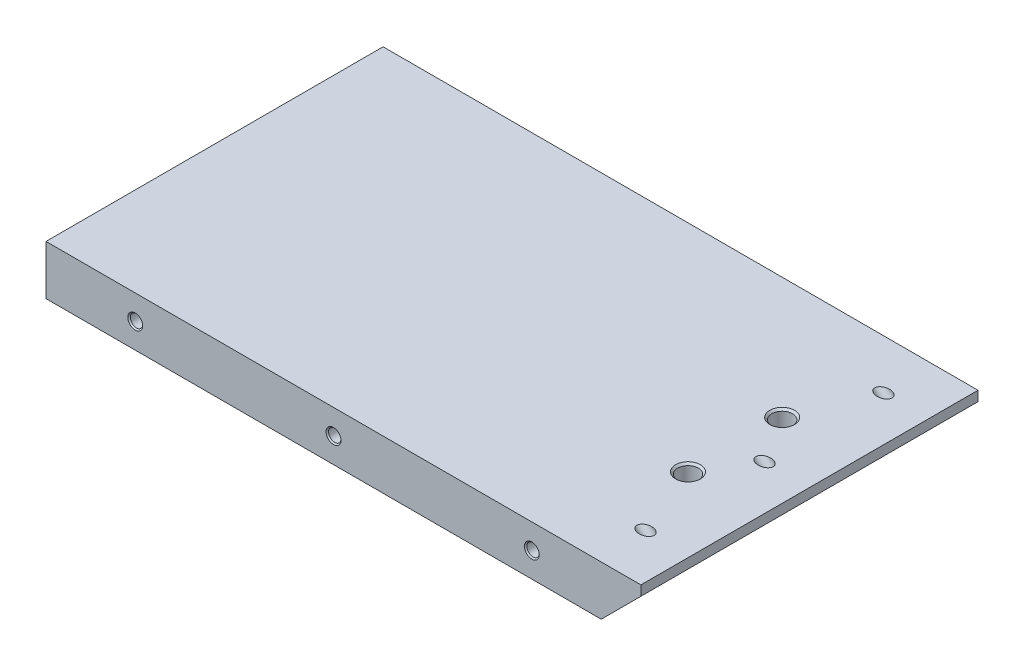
ISO-10303-21;
HEADER;
FILE_DESCRIPTION(('STEP AP214'),'2;1');
FILE_NAME('part.step','',(''),(''),'','','');
FILE_SCHEMA(('AUTOMOTIVE_DESIGN { 1 0 10303 214 1 1 1 1 }'));
ENDSEC;
DATA;
#1=APPLICATION_CONTEXT('core data for automotive mechanical design processes');
#2=APPLICATION_PROTOCOL_DEFINITION('international standard','automotive_design',2000,#1);
#3=PRODUCT_CONTEXT('',#1,'mechanical');
#4=PRODUCT('Part','Part','',(#3));
#5=PRODUCT_RELATED_PRODUCT_CATEGORY('part','',(#4));
#6=PRODUCT_DEFINITION_FORMATION('','',#4);
#7=PRODUCT_DEFINITION_CONTEXT('part definition',#1,'design');
#8=PRODUCT_DEFINITION('design','',#6,#7);
#9=PRODUCT_DEFINITION_SHAPE('','',#8);
#10=(LENGTH_UNIT() NAMED_UNIT(*) SI_UNIT(.MILLI.,.METRE.));
#11=(NAMED_UNIT(*) PLANE_ANGLE_UNIT() SI_UNIT($,.RADIAN.));
#12=(NAMED_UNIT(*) SI_UNIT($,.STERADIAN.) SOLID_ANGLE_UNIT());
#13=UNCERTAINTY_MEASURE_WITH_UNIT(LENGTH_MEASURE(1.E-05),#10,'distance_accuracy_value','');
#14=(GEOMETRIC_REPRESENTATION_CONTEXT(3) GLOBAL_UNCERTAINTY_ASSIGNED_CONTEXT((#13)) GLOBAL_UNIT_ASSIGNED_CONTEXT((#10,
#11,#12)) REPRESENTATION_CONTEXT('',''));
#15=CARTESIAN_POINT('',(0.,0.,0.));
#16=DIRECTION('',(0.,0.,1.));
#17=DIRECTION('',(1.,0.,0.));
#18=AXIS2_PLACEMENT_3D('',#15,#16,#17);
#19=CARTESIAN_POINT('',(0.,-5.,34.));
#20=DIRECTION('',(1.,0.,0.));
#21=DIRECTION('',(0.,1.,0.));
#22=AXIS2_PLACEMENT_3D('',#19,#20,#21);
#23=PLANE('',#22);
#24=CARTESIAN_POINT('',(0.,0.,22.5));
#25=DIRECTION('',(-1.,0.,0.));
#26=DIRECTION('',(0.,0.,1.));
#27=AXIS2_PLACEMENT_3D('',#24,#25,#26);
#28=CIRCLE('',#27,3.);
#29=CARTESIAN_POINT('',(0.,0.,25.5));
#30=VERTEX_POINT('',#29);
#31=EDGE_CURVE('E198',#30,#30,#28,.T.);
#32=ORIENTED_EDGE('',*,*,#31,.F.);
#33=EDGE_LOOP('',(#32));
#34=FACE_BOUND('',#33,.T.);
#35=CARTESIAN_POINT('',(0.,0.,-22.5));
#36=DIRECTION('',(-1.,0.,0.));
#37=DIRECTION('',(0.,0.,1.));
#38=AXIS2_PLACEMENT_3D('',#35,#36,#37);
#39=CIRCLE('',#38,3.);
#40=CARTESIAN_POINT('',(0.,0.,-19.5));
#41=VERTEX_POINT('',#40);
#42=EDGE_CURVE('E213',#41,#41,#39,.T.);
#43=ORIENTED_EDGE('',*,*,#42,.F.);
#44=EDGE_LOOP('',(#43));
#45=FACE_BOUND('',#44,.T.);
#46=CARTESIAN_POINT('',(0.,0.,29.));
#47=DIRECTION('',(-1.,0.,0.));
#48=DIRECTION('',(0.,0.,1.));
#49=AXIS2_PLACEMENT_3D('',#46,#47,#48);
#50=CIRCLE('',#49,2.5);
#51=CARTESIAN_POINT('',(0.,0.,31.5));
#52=VERTEX_POINT('',#51);
#53=EDGE_CURVE('E216',#52,#52,#50,.T.);
#54=ORIENTED_EDGE('',*,*,#53,.F.);
#55=EDGE_LOOP('',(#54));
#56=FACE_BOUND('',#55,.T.);
#57=CARTESIAN_POINT('',(0.,0.,-29.));
#58=DIRECTION('',(-1.,0.,0.));
#59=DIRECTION('',(0.,0.,1.));
#60=AXIS2_PLACEMENT_3D('',#57,#58,#59);
#61=CIRCLE('',#60,2.5);
#62=CARTESIAN_POINT('',(0.,0.,-26.5));
#63=VERTEX_POINT('',#62);
#64=EDGE_CURVE('E231',#63,#63,#61,.T.);
#65=ORIENTED_EDGE('',*,*,#64,.F.);
#66=EDGE_LOOP('',(#65));
#67=FACE_BOUND('',#66,.T.);
#68=DIRECTION('',(0.,-1.,0.));
#69=VECTOR('',#68,1.);
#70=CARTESIAN_POINT('',(0.,-5.,-34.));
#71=LINE('',#70,#69);
#72=CARTESIAN_POINT('',(0.,5.,-34.));
#73=VERTEX_POINT('',#72);
#74=CARTESIAN_POINT('',(0.,-5.,-34.));
#75=VERTEX_POINT('',#74);
#76=EDGE_CURVE('E234',#73,#75,#71,.T.);
#77=ORIENTED_EDGE('',*,*,#76,.T.);
#78=DIRECTION('',(0.,0.,-1.));
#79=VECTOR('',#78,1.);
#80=CARTESIAN_POINT('',(0.,-5.,34.));
#81=LINE('',#80,#79);
#82=CARTESIAN_POINT('',(0.,-5.,34.));
#83=VERTEX_POINT('',#82);
#84=EDGE_CURVE('E258',#83,#75,#81,.T.);
#85=ORIENTED_EDGE('',*,*,#84,.F.);
#86=DIRECTION('',(0.,-1.,0.));
#87=VECTOR('',#86,1.);
#88=CARTESIAN_POINT('',(0.,-5.,34.));
#89=LINE('',#88,#87);
#90=CARTESIAN_POINT('',(0.,5.,34.));
#91=VERTEX_POINT('',#90);
#92=EDGE_CURVE('E243',#91,#83,#89,.T.);
#93=ORIENTED_EDGE('',*,*,#92,.F.);
#94=DIRECTION('',(0.,0.,-1.));
#95=VECTOR('',#94,1.);
#96=CARTESIAN_POINT('',(0.,5.,34.));
#97=LINE('',#96,#95);
#98=EDGE_CURVE('E252',#91,#73,#97,.T.);
#99=ORIENTED_EDGE('',*,*,#98,.T.);
#100=EDGE_LOOP('',(#77,#85,#93,#99));
#101=FACE_BOUND('',#100,.T.);
#102=ADVANCED_FACE('F33',(#34,#45,#56,#67,#101),#23,.F.);
#103=CARTESIAN_POINT('',(0.,-5.,34.));
#104=DIRECTION('',(0.,1.,0.));
#105=DIRECTION('',(-1.,0.,0.));
#106=AXIS2_PLACEMENT_3D('',#103,#104,#105);
#107=PLANE('',#106);
#108=CARTESIAN_POINT('',(105.,-5.,-9.5));
#109=DIRECTION('',(0.,1.,0.));
#110=DIRECTION('',(0.,0.,1.));
#111=AXIS2_PLACEMENT_3D('',#108,#109,#110);
#112=CIRCLE('',#111,2.1);
#113=CARTESIAN_POINT('',(105.,-5.,-7.4));
#114=VERTEX_POINT('',#113);
#115=EDGE_CURVE('E180',#114,#114,#112,.T.);
#116=ORIENTED_EDGE('',*,*,#115,.T.);
#117=EDGE_LOOP('',(#116));
#118=FACE_BOUND('',#117,.T.);
#119=CARTESIAN_POINT('',(105.,-5.,9.5));
#120=DIRECTION('',(0.,1.,0.));
#121=DIRECTION('',(0.,0.,1.));
#122=AXIS2_PLACEMENT_3D('',#119,#120,#121);
#123=CIRCLE('',#122,2.1);
#124=CARTESIAN_POINT('',(105.,-5.,11.6));
#125=VERTEX_POINT('',#124);
#126=EDGE_CURVE('E189',#125,#125,#123,.T.);
#127=ORIENTED_EDGE('',*,*,#126,.T.);
#128=EDGE_LOOP('',(#127));
#129=FACE_BOUND('',#128,.T.);
#130=DIRECTION('',(1.,0.,0.));
#131=VECTOR('',#130,1.);
#132=CARTESIAN_POINT('',(0.,-5.,-34.));
#133=LINE('',#132,#131);
#134=CARTESIAN_POINT('',(112.,-4.99999999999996,-34.));
#135=VERTEX_POINT('',#134);
#136=EDGE_CURVE('E237',#75,#135,#133,.T.);
#137=ORIENTED_EDGE('',*,*,#136,.T.);
#138=DIRECTION('',(0.,0.,1.));
#139=VECTOR('',#138,1.);
#140=CARTESIAN_POINT('',(112.,-4.99999999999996,34.));
#141=LINE('',#140,#139);
#142=CARTESIAN_POINT('',(112.,-4.99999999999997,34.));
#143=VERTEX_POINT('',#142);
#144=EDGE_CURVE('E51',#135,#143,#141,.T.);
#145=ORIENTED_EDGE('',*,*,#144,.T.);
#146=DIRECTION('',(1.,0.,0.));
#147=VECTOR('',#146,1.);
#148=CARTESIAN_POINT('',(0.,-5.,34.));
#149=LINE('',#148,#147);
#150=EDGE_CURVE('E246',#83,#143,#149,.T.);
#151=ORIENTED_EDGE('',*,*,#150,.F.);
#152=ORIENTED_EDGE('',*,*,#84,.T.);
#153=EDGE_LOOP('',(#137,#145,#151,#152));
#154=FACE_BOUND('',#153,.T.);
#155=ADVANCED_FACE('F311',(#118,#129,#154),#107,.F.);
#156=CARTESIAN_POINT('',(120.,-4.99999999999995,34.));
#157=DIRECTION('',(-1.,0.,0.));
#158=DIRECTION('',(0.,0.,1.));
#159=AXIS2_PLACEMENT_3D('',#156,#157,#158);
#160=PLANE('',#159);
#161=DIRECTION('',(0.,1.,0.));
#162=VECTOR('',#161,1.);
#163=CARTESIAN_POINT('',(120.,-4.99999999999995,34.));
#164=LINE('',#163,#162);
#165=CARTESIAN_POINT('',(120.,3.00000000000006,34.));
#166=VERTEX_POINT('',#165);
#167=CARTESIAN_POINT('',(120.,5.,34.));
#168=VERTEX_POINT('',#167);
#169=EDGE_CURVE('E248',#166,#168,#164,.T.);
#170=ORIENTED_EDGE('',*,*,#169,.F.);
#171=DIRECTION('',(0.,0.,-1.));
#172=VECTOR('',#171,1.);
#173=CARTESIAN_POINT('',(120.,3.00000000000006,34.));
#174=LINE('',#173,#172);
#175=CARTESIAN_POINT('',(120.,3.00000000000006,-34.));
#176=VERTEX_POINT('',#175);
#177=EDGE_CURVE('E261',#166,#176,#174,.T.);
#178=ORIENTED_EDGE('',*,*,#177,.T.);
#179=DIRECTION('',(0.,1.,0.));
#180=VECTOR('',#179,1.);
#181=CARTESIAN_POINT('',(120.,-4.99999999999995,-34.));
#182=LINE('',#181,#180);
#183=CARTESIAN_POINT('',(120.,5.,-34.));
#184=VERTEX_POINT('',#183);
#185=EDGE_CURVE('E239',#176,#184,#182,.T.);
#186=ORIENTED_EDGE('',*,*,#185,.T.);
#187=DIRECTION('',(0.,0.,-1.));
#188=VECTOR('',#187,1.);
#189=CARTESIAN_POINT('',(120.,5.,34.));
#190=LINE('',#189,#188);
#191=EDGE_CURVE('E255',#168,#184,#190,.T.);
#192=ORIENTED_EDGE('',*,*,#191,.F.);
#193=EDGE_LOOP('',(#170,#178,#186,#192));
#194=FACE_BOUND('',#193,.T.);
#195=ADVANCED_FACE('F317',(#194),#160,.F.);
#196=CARTESIAN_POINT('',(0.,5.,34.));
#197=DIRECTION('',(0.,-1.,0.));
#198=DIRECTION('',(1.,0.,0.));
#199=AXIS2_PLACEMENT_3D('',#196,#197,#198);
#200=PLANE('',#199);
#201=CARTESIAN_POINT('',(110.928932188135,5.,-24.));
#202=DIRECTION('',(0.,-1.,0.));
#203=DIRECTION('',(1.,0.,0.));
#204=AXIS2_PLACEMENT_3D('',#201,#202,#203);
#205=ELLIPSE('',#204,1.76776695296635,1.24999999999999);
#206=CARTESIAN_POINT('',(112.696699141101,5.,-24.));
#207=VERTEX_POINT('',#206);
#208=EDGE_CURVE('E165',#207,#207,#205,.T.);
#209=ORIENTED_EDGE('',*,*,#208,.T.);
#210=EDGE_LOOP('',(#209));
#211=FACE_BOUND('',#210,.T.);
#212=CARTESIAN_POINT('',(110.928932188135,5.,0.));
#213=DIRECTION('',(0.,-1.,0.));
#214=DIRECTION('',(1.,0.,0.));
#215=AXIS2_PLACEMENT_3D('',#212,#213,#214);
#216=ELLIPSE('',#215,1.76776695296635,1.24999999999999);
#217=CARTESIAN_POINT('',(112.696699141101,5.,0.));
#218=VERTEX_POINT('',#217);
#219=EDGE_CURVE('E172',#218,#218,#216,.T.);
#220=ORIENTED_EDGE('',*,*,#219,.T.);
#221=EDGE_LOOP('',(#220));
#222=FACE_BOUND('',#221,.T.);
#223=CARTESIAN_POINT('',(110.928932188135,5.,24.));
#224=DIRECTION('',(0.,-1.,0.));
#225=DIRECTION('',(1.,0.,0.));
#226=AXIS2_PLACEMENT_3D('',#223,#224,#225);
#227=ELLIPSE('',#226,1.76776695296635,1.24999999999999);
#228=CARTESIAN_POINT('',(112.696699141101,5.,24.));
#229=VERTEX_POINT('',#228);
#230=EDGE_CURVE('E179',#229,#229,#227,.T.);
#231=ORIENTED_EDGE('',*,*,#230,.T.);
#232=EDGE_LOOP('',(#231));
#233=FACE_BOUND('',#232,.T.);
#234=CARTESIAN_POINT('',(105.,5.,-9.5));
#235=DIRECTION('',(0.,1.,0.));
#236=DIRECTION('',(0.,0.,1.));
#237=AXIS2_PLACEMENT_3D('',#234,#235,#236);
#238=CIRCLE('',#237,2.5);
#239=CARTESIAN_POINT('',(105.,5.,-7.));
#240=VERTEX_POINT('',#239);
#241=EDGE_CURVE('E186',#240,#240,#238,.T.);
#242=ORIENTED_EDGE('',*,*,#241,.F.);
#243=EDGE_LOOP('',(#242));
#244=FACE_BOUND('',#243,.T.);
#245=CARTESIAN_POINT('',(105.,5.,9.5));
#246=DIRECTION('',(0.,1.,0.));
#247=DIRECTION('',(0.,0.,1.));
#248=AXIS2_PLACEMENT_3D('',#245,#246,#247);
#249=CIRCLE('',#248,2.5);
#250=CARTESIAN_POINT('',(105.,5.,12.));
#251=VERTEX_POINT('',#250);
#252=EDGE_CURVE('E195',#251,#251,#249,.T.);
#253=ORIENTED_EDGE('',*,*,#252,.F.);
#254=EDGE_LOOP('',(#253));
#255=FACE_BOUND('',#254,.T.);
#256=DIRECTION('',(-1.,0.,0.));
#257=VECTOR('',#256,1.);
#258=CARTESIAN_POINT('',(0.,5.,-34.));
#259=LINE('',#258,#257);
#260=EDGE_CURVE('E241',#184,#73,#259,.T.);
#261=ORIENTED_EDGE('',*,*,#260,.T.);
#262=ORIENTED_EDGE('',*,*,#98,.F.);
#263=DIRECTION('',(-1.,0.,0.));
#264=VECTOR('',#263,1.);
#265=CARTESIAN_POINT('',(0.,5.,34.));
#266=LINE('',#265,#264);
#267=EDGE_CURVE('E250',#168,#91,#266,.T.);
#268=ORIENTED_EDGE('',*,*,#267,.F.);
#269=ORIENTED_EDGE('',*,*,#191,.T.);
#270=EDGE_LOOP('',(#261,#262,#268,#269));
#271=FACE_BOUND('',#270,.T.);
#272=ADVANCED_FACE('F305',(#211,#222,#233,#244,#255,#271),#200,.F.);
#273=CARTESIAN_POINT('',(0.,-5.,34.));
#274=DIRECTION('',(0.,0.,-1.));
#275=DIRECTION('',(-1.,0.,0.));
#276=AXIS2_PLACEMENT_3D('',#273,#274,#275);
#277=PLANE('',#276);
#278=CARTESIAN_POINT('',(98.,0.,34.));
#279=DIRECTION('',(0.,0.,1.));
#280=DIRECTION('',(1.,0.,0.));
#281=AXIS2_PLACEMENT_3D('',#278,#279,#280);
#282=CIRCLE('',#281,1.5);
#283=CARTESIAN_POINT('',(99.5,0.,34.));
#284=VERTEX_POINT('',#283);
#285=EDGE_CURVE('E138',#284,#284,#282,.T.);
#286=ORIENTED_EDGE('',*,*,#285,.F.);
#287=EDGE_LOOP('',(#286));
#288=FACE_BOUND('',#287,.T.);
#289=CARTESIAN_POINT('',(58.,0.,34.));
#290=DIRECTION('',(0.,0.,1.));
#291=DIRECTION('',(1.,0.,0.));
#292=AXIS2_PLACEMENT_3D('',#289,#290,#291);
#293=CIRCLE('',#292,1.5);
#294=CARTESIAN_POINT('',(59.5,0.,34.));
#295=VERTEX_POINT('',#294);
#296=EDGE_CURVE('E147',#295,#295,#293,.T.);
#297=ORIENTED_EDGE('',*,*,#296,.F.);
#298=EDGE_LOOP('',(#297));
#299=FACE_BOUND('',#298,.T.);
#300=CARTESIAN_POINT('',(18.,0.,34.));
#301=DIRECTION('',(0.,0.,1.));
#302=DIRECTION('',(1.,0.,0.));
#303=AXIS2_PLACEMENT_3D('',#300,#301,#302);
#304=CIRCLE('',#303,1.5);
#305=CARTESIAN_POINT('',(19.5,0.,34.));
#306=VERTEX_POINT('',#305);
#307=EDGE_CURVE('E156',#306,#306,#304,.T.);
#308=ORIENTED_EDGE('',*,*,#307,.F.);
#309=EDGE_LOOP('',(#308));
#310=FACE_BOUND('',#309,.T.);
#311=ORIENTED_EDGE('',*,*,#150,.T.);
#312=DIRECTION('',(-0.707106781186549,-0.707106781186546,0.));
#313=VECTOR('',#312,1.);
#314=CARTESIAN_POINT('',(120.,3.00000000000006,34.));
#315=LINE('',#314,#313);
#316=EDGE_CURVE('E267',#143,#166,#315,.F.);
#317=ORIENTED_EDGE('',*,*,#316,.T.);
#318=ORIENTED_EDGE('',*,*,#169,.T.);
#319=ORIENTED_EDGE('',*,*,#267,.T.);
#320=ORIENTED_EDGE('',*,*,#92,.T.);
#321=EDGE_LOOP('',(#311,#317,#318,#319,#320));
#322=FACE_BOUND('',#321,.T.);
#323=ADVANCED_FACE('F295',(#288,#299,#310,#322),#277,.F.);
#324=CARTESIAN_POINT('',(0.,-5.,-34.));
#325=DIRECTION('',(0.,0.,-1.));
#326=DIRECTION('',(-1.,0.,0.));
#327=AXIS2_PLACEMENT_3D('',#324,#325,#326);
#328=PLANE('',#327);
#329=CARTESIAN_POINT('',(58.,0.,-34.));
#330=DIRECTION('',(0.,0.,-1.));
#331=DIRECTION('',(-1.,0.,0.));
#332=AXIS2_PLACEMENT_3D('',#329,#330,#331);
#333=CIRCLE('',#332,1.5);
#334=CARTESIAN_POINT('',(56.5,0.,-34.));
#335=VERTEX_POINT('',#334);
#336=EDGE_CURVE('E123',#335,#335,#333,.T.);
#337=ORIENTED_EDGE('',*,*,#336,.F.);
#338=EDGE_LOOP('',(#337));
#339=FACE_BOUND('',#338,.T.);
#340=CARTESIAN_POINT('',(18.,0.,-34.));
#341=DIRECTION('',(0.,0.,-1.));
#342=DIRECTION('',(-1.,0.,0.));
#343=AXIS2_PLACEMENT_3D('',#340,#341,#342);
#344=CIRCLE('',#343,1.5);
#345=CARTESIAN_POINT('',(16.5,0.,-34.));
#346=VERTEX_POINT('',#345);
#347=EDGE_CURVE('E116',#346,#346,#344,.T.);
#348=ORIENTED_EDGE('',*,*,#347,.F.);
#349=EDGE_LOOP('',(#348));
#350=FACE_BOUND('',#349,.T.);
#351=ORIENTED_EDGE('',*,*,#185,.F.);
#352=DIRECTION('',(0.707106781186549,0.707106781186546,0.));
#353=VECTOR('',#352,1.);
#354=CARTESIAN_POINT('',(55.9999999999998,-61.,-34.));
#355=LINE('',#354,#353);
#356=EDGE_CURVE('E264',#176,#135,#355,.F.);
#357=ORIENTED_EDGE('',*,*,#356,.T.);
#358=ORIENTED_EDGE('',*,*,#136,.F.);
#359=ORIENTED_EDGE('',*,*,#76,.F.);
#360=ORIENTED_EDGE('',*,*,#260,.F.);
#361=EDGE_LOOP('',(#351,#357,#358,#359,#360));
#362=FACE_BOUND('',#361,.T.);
#363=CARTESIAN_POINT('',(98.,0.,-34.));
#364=DIRECTION('',(0.,0.,-1.));
#365=DIRECTION('',(-1.,0.,0.));
#366=AXIS2_PLACEMENT_3D('',#363,#364,#365);
#367=CIRCLE('',#366,1.5);
#368=CARTESIAN_POINT('',(96.5,0.,-34.));
#369=VERTEX_POINT('',#368);
#370=EDGE_CURVE('E269',#369,#369,#367,.T.);
#371=ORIENTED_EDGE('',*,*,#370,.F.);
#372=EDGE_LOOP('',(#371));
#373=FACE_BOUND('',#372,.T.);
#374=ADVANCED_FACE('F292',(#339,#350,#362,#373),#328,.T.);
#375=CARTESIAN_POINT('',(120.,3.00000000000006,34.));
#376=DIRECTION('',(-0.707106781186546,0.707106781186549,0.));
#377=DIRECTION('',(-0.707106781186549,-0.707106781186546,0.));
#378=AXIS2_PLACEMENT_3D('',#375,#376,#377);
#379=PLANE('',#378);
#380=CARTESIAN_POINT('',(116.464466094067,-0.535533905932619,-24.));
#381=DIRECTION('',(0.707106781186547,-0.707106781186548,0.));
#382=DIRECTION('',(0.707106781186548,0.707106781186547,0.));
#383=AXIS2_PLACEMENT_3D('',#380,#381,#382);
#384=CIRCLE('',#383,2.);
#385=CARTESIAN_POINT('',(117.87867965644,0.878679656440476,-24.));
#386=VERTEX_POINT('',#385);
#387=EDGE_CURVE('E162',#386,#386,#384,.T.);
#388=ORIENTED_EDGE('',*,*,#387,.F.);
#389=EDGE_LOOP('',(#388));
#390=FACE_BOUND('',#389,.T.);
#391=CARTESIAN_POINT('',(116.464466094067,-0.535533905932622,0.));
#392=DIRECTION('',(0.707106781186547,-0.707106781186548,0.));
#393=DIRECTION('',(0.707106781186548,0.707106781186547,0.));
#394=AXIS2_PLACEMENT_3D('',#391,#392,#393);
#395=CIRCLE('',#394,2.);
#396=CARTESIAN_POINT('',(117.87867965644,0.878679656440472,0.));
#397=VERTEX_POINT('',#396);
#398=EDGE_CURVE('E169',#397,#397,#395,.T.);
#399=ORIENTED_EDGE('',*,*,#398,.F.);
#400=EDGE_LOOP('',(#399));
#401=FACE_BOUND('',#400,.T.);
#402=CARTESIAN_POINT('',(116.464466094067,-0.535533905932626,24.));
#403=DIRECTION('',(0.707106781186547,-0.707106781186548,0.));
#404=DIRECTION('',(0.707106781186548,0.707106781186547,0.));
#405=AXIS2_PLACEMENT_3D('',#402,#403,#404);
#406=CIRCLE('',#405,2.);
#407=CARTESIAN_POINT('',(117.87867965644,0.878679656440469,24.));
#408=VERTEX_POINT('',#407);
#409=EDGE_CURVE('E176',#408,#408,#406,.T.);
#410=ORIENTED_EDGE('',*,*,#409,.F.);
#411=EDGE_LOOP('',(#410));
#412=FACE_BOUND('',#411,.T.);
#413=ORIENTED_EDGE('',*,*,#316,.F.);
#414=ORIENTED_EDGE('',*,*,#144,.F.);
#415=ORIENTED_EDGE('',*,*,#356,.F.);
#416=ORIENTED_EDGE('',*,*,#177,.F.);
#417=EDGE_LOOP('',(#413,#414,#415,#416));
#418=FACE_BOUND('',#417,.T.);
#419=ADVANCED_FACE('F294',(#390,#401,#412,#418),#379,.F.);
#420=CARTESIAN_POINT('',(0.,0.,-29.));
#421=DIRECTION('',(-1.,0.,0.));
#422=DIRECTION('',(0.,0.,1.));
#423=AXIS2_PLACEMENT_3D('',#420,#421,#422);
#424=CONICAL_SURFACE('',#423,2.5,0.785398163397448);
#425=CARTESIAN_POINT('',(0.400000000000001,0.,-29.));
#426=DIRECTION('',(-1.,0.,0.));
#427=DIRECTION('',(0.,0.,1.));
#428=AXIS2_PLACEMENT_3D('',#425,#426,#427);
#429=CIRCLE('',#428,2.1);
#430=CARTESIAN_POINT('',(0.400000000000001,0.,-26.9));
#431=VERTEX_POINT('',#430);
#432=EDGE_CURVE('E228',#431,#431,#429,.T.);
#433=ORIENTED_EDGE('',*,*,#432,.F.);
#434=EDGE_LOOP('',(#433));
#435=FACE_BOUND('',#434,.T.);
#436=ORIENTED_EDGE('',*,*,#64,.T.);
#437=EDGE_LOOP('',(#436));
#438=FACE_BOUND('',#437,.T.);
#439=ADVANCED_FACE('F302',(#435,#438),#424,.F.);
#440=CARTESIAN_POINT('',(0.,0.,-29.));
#441=DIRECTION('',(-1.,0.,0.));
#442=DIRECTION('',(0.,0.,1.));
#443=AXIS2_PLACEMENT_3D('',#440,#441,#442);
#444=CYLINDRICAL_SURFACE('',#443,2.1);
#445=CARTESIAN_POINT('',(15.,0.,-29.));
#446=DIRECTION('',(-1.,0.,0.));
#447=DIRECTION('',(0.,0.,1.));
#448=AXIS2_PLACEMENT_3D('',#445,#446,#447);
#449=CIRCLE('',#448,2.1);
#450=CARTESIAN_POINT('',(15.,0.,-26.9));
#451=VERTEX_POINT('',#450);
#452=EDGE_CURVE('E225',#451,#451,#449,.T.);
#453=ORIENTED_EDGE('',*,*,#452,.F.);
#454=EDGE_LOOP('',(#453));
#455=FACE_BOUND('',#454,.T.);
#456=ORIENTED_EDGE('',*,*,#432,.T.);
#457=EDGE_LOOP('',(#456));
#458=FACE_BOUND('',#457,.T.);
#459=ADVANCED_FACE('F611',(#455,#458),#444,.F.);
#460=CARTESIAN_POINT('',(15.,0.,-29.));
#461=DIRECTION('',(-1.,0.,0.));
#462=DIRECTION('',(0.,0.,1.));
#463=AXIS2_PLACEMENT_3D('',#460,#461,#462);
#464=CONICAL_SURFACE('',#463,2.1,1.02974425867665);
#465=CARTESIAN_POINT('',(16.2618072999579,0.,-29.));
#466=VERTEX_POINT('',#465);
#467=VERTEX_LOOP('',#466);
#468=FACE_BOUND('',#467,.T.);
#469=ORIENTED_EDGE('',*,*,#452,.T.);
#470=EDGE_LOOP('',(#469));
#471=FACE_BOUND('',#470,.T.);
#472=ADVANCED_FACE('F591',(#468,#471),#464,.F.);
#473=CARTESIAN_POINT('',(0.,0.,29.));
#474=DIRECTION('',(-1.,0.,0.));
#475=DIRECTION('',(0.,0.,1.));
#476=AXIS2_PLACEMENT_3D('',#473,#474,#475);
#477=CONICAL_SURFACE('',#476,2.5,0.785398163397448);
#478=CARTESIAN_POINT('',(0.400000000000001,0.,29.));
#479=DIRECTION('',(-1.,0.,0.));
#480=DIRECTION('',(0.,0.,1.));
#481=AXIS2_PLACEMENT_3D('',#478,#479,#480);
#482=CIRCLE('',#481,2.1);
#483=CARTESIAN_POINT('',(0.400000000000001,0.,31.1));
#484=VERTEX_POINT('',#483);
#485=EDGE_CURVE('E222',#484,#484,#482,.T.);
#486=ORIENTED_EDGE('',*,*,#485,.F.);
#487=EDGE_LOOP('',(#486));
#488=FACE_BOUND('',#487,.T.);
#489=ORIENTED_EDGE('',*,*,#53,.T.);
#490=EDGE_LOOP('',(#489));
#491=FACE_BOUND('',#490,.T.);
#492=ADVANCED_FACE('F582',(#488,#491),#477,.F.);
#493=CARTESIAN_POINT('',(0.,0.,29.));
#494=DIRECTION('',(-1.,0.,0.));
#495=DIRECTION('',(0.,0.,1.));
#496=AXIS2_PLACEMENT_3D('',#493,#494,#495);
#497=CYLINDRICAL_SURFACE('',#496,2.1);
#498=CARTESIAN_POINT('',(15.,0.,29.));
#499=DIRECTION('',(-1.,0.,0.));
#500=DIRECTION('',(0.,0.,1.));
#501=AXIS2_PLACEMENT_3D('',#498,#499,#500);
#502=CIRCLE('',#501,2.1);
#503=CARTESIAN_POINT('',(15.,0.,31.1));
#504=VERTEX_POINT('',#503);
#505=EDGE_CURVE('E219',#504,#504,#502,.T.);
#506=ORIENTED_EDGE('',*,*,#505,.F.);
#507=EDGE_LOOP('',(#506));
#508=FACE_BOUND('',#507,.T.);
#509=ORIENTED_EDGE('',*,*,#485,.T.);
#510=EDGE_LOOP('',(#509));
#511=FACE_BOUND('',#510,.T.);
#512=ADVANCED_FACE('F588',(#508,#511),#497,.F.);
#513=CARTESIAN_POINT('',(15.,0.,29.));
#514=DIRECTION('',(-1.,0.,0.));
#515=DIRECTION('',(0.,0.,1.));
#516=AXIS2_PLACEMENT_3D('',#513,#514,#515);
#517=CONICAL_SURFACE('',#516,2.1,1.02974425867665);
#518=CARTESIAN_POINT('',(16.2618072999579,0.,29.));
#519=VERTEX_POINT('',#518);
#520=VERTEX_LOOP('',#519);
#521=FACE_BOUND('',#520,.T.);
#522=ORIENTED_EDGE('',*,*,#505,.T.);
#523=EDGE_LOOP('',(#522));
#524=FACE_BOUND('',#523,.T.);
#525=ADVANCED_FACE('F579',(#521,#524),#517,.F.);
#526=CARTESIAN_POINT('',(0.,0.,-22.5));
#527=DIRECTION('',(-1.,0.,0.));
#528=DIRECTION('',(0.,0.,1.));
#529=AXIS2_PLACEMENT_3D('',#526,#527,#528);
#530=CONICAL_SURFACE('',#529,3.,0.785398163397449);
#531=CARTESIAN_POINT('',(0.5,0.,-22.5));
#532=DIRECTION('',(-1.,0.,0.));
#533=DIRECTION('',(0.,0.,1.));
#534=AXIS2_PLACEMENT_3D('',#531,#532,#533);
#535=CIRCLE('',#534,2.5);
#536=CARTESIAN_POINT('',(0.5,0.,-20.));
#537=VERTEX_POINT('',#536);
#538=EDGE_CURVE('E210',#537,#537,#535,.T.);
#539=ORIENTED_EDGE('',*,*,#538,.F.);
#540=EDGE_LOOP('',(#539));
#541=FACE_BOUND('',#540,.T.);
#542=ORIENTED_EDGE('',*,*,#42,.T.);
#543=EDGE_LOOP('',(#542));
#544=FACE_BOUND('',#543,.T.);
#545=ADVANCED_FACE('F571',(#541,#544),#530,.F.);
#546=CARTESIAN_POINT('',(0.,0.,-22.5));
#547=DIRECTION('',(-1.,0.,0.));
#548=DIRECTION('',(0.,0.,1.));
#549=AXIS2_PLACEMENT_3D('',#546,#547,#548);
#550=CYLINDRICAL_SURFACE('',#549,2.5);
#551=CARTESIAN_POINT('',(12.,0.,-22.5));
#552=DIRECTION('',(-1.,0.,0.));
#553=DIRECTION('',(0.,0.,1.));
#554=AXIS2_PLACEMENT_3D('',#551,#552,#553);
#555=CIRCLE('',#554,2.5);
#556=CARTESIAN_POINT('',(12.,0.,-20.));
#557=VERTEX_POINT('',#556);
#558=EDGE_CURVE('E207',#557,#557,#555,.T.);
#559=ORIENTED_EDGE('',*,*,#558,.F.);
#560=EDGE_LOOP('',(#559));
#561=FACE_BOUND('',#560,.T.);
#562=ORIENTED_EDGE('',*,*,#538,.T.);
#563=EDGE_LOOP('',(#562));
#564=FACE_BOUND('',#563,.T.);
#565=ADVANCED_FACE('F563',(#561,#564),#550,.F.);
#566=CARTESIAN_POINT('',(12.,0.,-22.5));
#567=DIRECTION('',(-1.,0.,0.));
#568=DIRECTION('',(0.,0.,1.));
#569=AXIS2_PLACEMENT_3D('',#566,#567,#568);
#570=CONICAL_SURFACE('',#569,2.5,1.02974425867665);
#571=CARTESIAN_POINT('',(13.5021515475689,0.,-22.5));
#572=VERTEX_POINT('',#571);
#573=VERTEX_LOOP('',#572);
#574=FACE_BOUND('',#573,.T.);
#575=ORIENTED_EDGE('',*,*,#558,.T.);
#576=EDGE_LOOP('',(#575));
#577=FACE_BOUND('',#576,.T.);
#578=ADVANCED_FACE('F543',(#574,#577),#570,.F.);
#579=CARTESIAN_POINT('',(0.,0.,22.5));
#580=DIRECTION('',(-1.,0.,0.));
#581=DIRECTION('',(0.,0.,1.));
#582=AXIS2_PLACEMENT_3D('',#579,#580,#581);
#583=CONICAL_SURFACE('',#582,3.,0.785398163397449);
#584=CARTESIAN_POINT('',(0.5,0.,22.5));
#585=DIRECTION('',(-1.,0.,0.));
#586=DIRECTION('',(0.,0.,1.));
#587=AXIS2_PLACEMENT_3D('',#584,#585,#586);
#588=CIRCLE('',#587,2.5);
#589=CARTESIAN_POINT('',(0.5,0.,25.));
#590=VERTEX_POINT('',#589);
#591=EDGE_CURVE('E204',#590,#590,#588,.T.);
#592=ORIENTED_EDGE('',*,*,#591,.F.);
#593=EDGE_LOOP('',(#592));
#594=FACE_BOUND('',#593,.T.);
#595=ORIENTED_EDGE('',*,*,#31,.T.);
#596=EDGE_LOOP('',(#595));
#597=FACE_BOUND('',#596,.T.);
#598=ADVANCED_FACE('F534',(#594,#597),#583,.F.);
#599=CARTESIAN_POINT('',(0.,0.,22.5));
#600=DIRECTION('',(-1.,0.,0.));
#601=DIRECTION('',(0.,0.,1.));
#602=AXIS2_PLACEMENT_3D('',#599,#600,#601);
#603=CYLINDRICAL_SURFACE('',#602,2.5);
#604=CARTESIAN_POINT('',(12.,0.,22.5));
#605=DIRECTION('',(-1.,0.,0.));
#606=DIRECTION('',(0.,0.,1.));
#607=AXIS2_PLACEMENT_3D('',#604,#605,#606);
#608=CIRCLE('',#607,2.5);
#609=CARTESIAN_POINT('',(12.,0.,25.));
#610=VERTEX_POINT('',#609);
#611=EDGE_CURVE('E201',#610,#610,#608,.T.);
#612=ORIENTED_EDGE('',*,*,#611,.F.);
#613=EDGE_LOOP('',(#612));
#614=FACE_BOUND('',#613,.T.);
#615=ORIENTED_EDGE('',*,*,#591,.T.);
#616=EDGE_LOOP('',(#615));
#617=FACE_BOUND('',#616,.T.);
#618=ADVANCED_FACE('F540',(#614,#617),#603,.F.);
#619=CARTESIAN_POINT('',(12.,0.,22.5));
#620=DIRECTION('',(-1.,0.,0.));
#621=DIRECTION('',(0.,0.,1.));
#622=AXIS2_PLACEMENT_3D('',#619,#620,#621);
#623=CONICAL_SURFACE('',#622,2.5,1.02974425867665);
#624=CARTESIAN_POINT('',(13.5021515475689,0.,22.5));
#625=VERTEX_POINT('',#624);
#626=VERTEX_LOOP('',#625);
#627=FACE_BOUND('',#626,.T.);
#628=ORIENTED_EDGE('',*,*,#611,.T.);
#629=EDGE_LOOP('',(#628));
#630=FACE_BOUND('',#629,.T.);
#631=ADVANCED_FACE('F531',(#627,#630),#623,.F.);
#632=CARTESIAN_POINT('',(105.,5.,9.5));
#633=DIRECTION('',(0.,1.,0.));
#634=DIRECTION('',(0.,0.,1.));
#635=AXIS2_PLACEMENT_3D('',#632,#633,#634);
#636=CONICAL_SURFACE('',#635,2.5,0.78539816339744);
#637=CARTESIAN_POINT('',(105.,4.6,9.5));
#638=DIRECTION('',(0.,1.,0.));
#639=DIRECTION('',(0.,0.,1.));
#640=AXIS2_PLACEMENT_3D('',#637,#638,#639);
#641=CIRCLE('',#640,2.1);
#642=CARTESIAN_POINT('',(105.,4.6,11.6));
#643=VERTEX_POINT('',#642);
#644=EDGE_CURVE('E192',#643,#643,#641,.T.);
#645=ORIENTED_EDGE('',*,*,#644,.F.);
#646=EDGE_LOOP('',(#645));
#647=FACE_BOUND('',#646,.T.);
#648=ORIENTED_EDGE('',*,*,#252,.T.);
#649=EDGE_LOOP('',(#648));
#650=FACE_BOUND('',#649,.T.);
#651=ADVANCED_FACE('F523',(#647,#650),#636,.F.);
#652=CARTESIAN_POINT('',(105.,5.,9.5));
#653=DIRECTION('',(0.,1.,0.));
#654=DIRECTION('',(0.,0.,1.));
#655=AXIS2_PLACEMENT_3D('',#652,#653,#654);
#656=CYLINDRICAL_SURFACE('',#655,2.1);
#657=ORIENTED_EDGE('',*,*,#126,.F.);
#658=EDGE_LOOP('',(#657));
#659=FACE_BOUND('',#658,.T.);
#660=ORIENTED_EDGE('',*,*,#644,.T.);
#661=EDGE_LOOP('',(#660));
#662=FACE_BOUND('',#661,.T.);
#663=ADVANCED_FACE('F514',(#659,#662),#656,.F.);
#664=CARTESIAN_POINT('',(105.,5.,-9.5));
#665=DIRECTION('',(0.,1.,0.));
#666=DIRECTION('',(0.,0.,1.));
#667=AXIS2_PLACEMENT_3D('',#664,#665,#666);
#668=CONICAL_SURFACE('',#667,2.5,0.78539816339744);
#669=CARTESIAN_POINT('',(105.,4.6,-9.5));
#670=DIRECTION('',(0.,1.,0.));
#671=DIRECTION('',(0.,0.,1.));
#672=AXIS2_PLACEMENT_3D('',#669,#670,#671);
#673=CIRCLE('',#672,2.1);
#674=CARTESIAN_POINT('',(105.,4.6,-7.4));
#675=VERTEX_POINT('',#674);
#676=EDGE_CURVE('E183',#675,#675,#673,.T.);
#677=ORIENTED_EDGE('',*,*,#676,.F.);
#678=EDGE_LOOP('',(#677));
#679=FACE_BOUND('',#678,.T.);
#680=ORIENTED_EDGE('',*,*,#241,.T.);
#681=EDGE_LOOP('',(#680));
#682=FACE_BOUND('',#681,.T.);
#683=ADVANCED_FACE('F506',(#679,#682),#668,.F.);
#684=CARTESIAN_POINT('',(105.,5.,-9.5));
#685=DIRECTION('',(0.,1.,0.));
#686=DIRECTION('',(0.,0.,1.));
#687=AXIS2_PLACEMENT_3D('',#684,#685,#686);
#688=CYLINDRICAL_SURFACE('',#687,2.1);
#689=ORIENTED_EDGE('',*,*,#115,.F.);
#690=EDGE_LOOP('',(#689));
#691=FACE_BOUND('',#690,.T.);
#692=ORIENTED_EDGE('',*,*,#676,.T.);
#693=EDGE_LOOP('',(#692));
#694=FACE_BOUND('',#693,.T.);
#695=ADVANCED_FACE('F498',(#691,#694),#688,.F.);
#696=CARTESIAN_POINT('',(116.464466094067,-0.535533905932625,24.));
#697=DIRECTION('',(0.707106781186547,-0.707106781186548,0.));
#698=DIRECTION('',(0.707106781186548,0.707106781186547,0.));
#699=AXIS2_PLACEMENT_3D('',#696,#697,#698);
#700=CYLINDRICAL_SURFACE('',#699,1.24999999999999);
#701=CARTESIAN_POINT('',(115.934136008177,-0.00520382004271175,24.));
#702=DIRECTION('',(0.707106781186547,-0.707106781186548,0.));
#703=DIRECTION('',(0.707106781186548,0.707106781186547,0.));
#704=AXIS2_PLACEMENT_3D('',#701,#702,#703);
#705=CIRCLE('',#704,1.25);
#706=CARTESIAN_POINT('',(116.81801948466,0.87867965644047,24.));
#707=VERTEX_POINT('',#706);
#708=EDGE_CURVE('E173',#707,#707,#705,.T.);
#709=ORIENTED_EDGE('',*,*,#708,.T.);
#710=EDGE_LOOP('',(#709));
#711=FACE_BOUND('',#710,.T.);
#712=ORIENTED_EDGE('',*,*,#230,.F.);
#713=EDGE_LOOP('',(#712));
#714=FACE_BOUND('',#713,.T.);
#715=ADVANCED_FACE('F489',(#711,#714),#700,.F.);
#716=CARTESIAN_POINT('',(116.464466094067,-0.535533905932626,24.));
#717=DIRECTION('',(0.707106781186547,-0.707106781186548,0.));
#718=DIRECTION('',(0.707106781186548,0.707106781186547,0.));
#719=AXIS2_PLACEMENT_3D('',#716,#717,#718);
#720=CONICAL_SURFACE('',#719,2.,0.785398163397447);
#721=ORIENTED_EDGE('',*,*,#708,.F.);
#722=EDGE_LOOP('',(#721));
#723=FACE_BOUND('',#722,.T.);
#724=ORIENTED_EDGE('',*,*,#409,.T.);
#725=EDGE_LOOP('',(#724));
#726=FACE_BOUND('',#725,.T.);
#727=ADVANCED_FACE('F480',(#723,#726),#720,.F.);
#728=CARTESIAN_POINT('',(116.464466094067,-0.535533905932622,0.));
#729=DIRECTION('',(0.707106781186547,-0.707106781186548,0.));
#730=DIRECTION('',(0.707106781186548,0.707106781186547,0.));
#731=AXIS2_PLACEMENT_3D('',#728,#729,#730);
#732=CYLINDRICAL_SURFACE('',#731,1.24999999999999);
#733=CARTESIAN_POINT('',(115.934136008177,-0.00520382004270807,0.));
#734=DIRECTION('',(0.707106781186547,-0.707106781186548,0.));
#735=DIRECTION('',(0.707106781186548,0.707106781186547,0.));
#736=AXIS2_PLACEMENT_3D('',#733,#734,#735);
#737=CIRCLE('',#736,1.25);
#738=CARTESIAN_POINT('',(116.81801948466,0.878679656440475,0.));
#739=VERTEX_POINT('',#738);
#740=EDGE_CURVE('E166',#739,#739,#737,.T.);
#741=ORIENTED_EDGE('',*,*,#740,.T.);
#742=EDGE_LOOP('',(#741));
#743=FACE_BOUND('',#742,.T.);
#744=ORIENTED_EDGE('',*,*,#219,.F.);
#745=EDGE_LOOP('',(#744));
#746=FACE_BOUND('',#745,.T.);
#747=ADVANCED_FACE('F472',(#743,#746),#732,.F.);
#748=CARTESIAN_POINT('',(116.464466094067,-0.535533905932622,0.));
#749=DIRECTION('',(0.707106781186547,-0.707106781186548,0.));
#750=DIRECTION('',(0.707106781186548,0.707106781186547,0.));
#751=AXIS2_PLACEMENT_3D('',#748,#749,#750);
#752=CONICAL_SURFACE('',#751,2.,0.785398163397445);
#753=ORIENTED_EDGE('',*,*,#740,.F.);
#754=EDGE_LOOP('',(#753));
#755=FACE_BOUND('',#754,.T.);
#756=ORIENTED_EDGE('',*,*,#398,.T.);
#757=EDGE_LOOP('',(#756));
#758=FACE_BOUND('',#757,.T.);
#759=ADVANCED_FACE('F464',(#755,#758),#752,.F.);
#760=CARTESIAN_POINT('',(116.464466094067,-0.535533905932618,-24.));
#761=DIRECTION('',(0.707106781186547,-0.707106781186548,0.));
#762=DIRECTION('',(0.707106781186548,0.707106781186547,0.));
#763=AXIS2_PLACEMENT_3D('',#760,#761,#762);
#764=CYLINDRICAL_SURFACE('',#763,1.24999999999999);
#765=CARTESIAN_POINT('',(115.934136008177,-0.00520382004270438,-24.));
#766=DIRECTION('',(0.707106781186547,-0.707106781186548,0.));
#767=DIRECTION('',(0.707106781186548,0.707106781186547,0.));
#768=AXIS2_PLACEMENT_3D('',#765,#766,#767);
#769=CIRCLE('',#768,1.25);
#770=CARTESIAN_POINT('',(116.81801948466,0.878679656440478,-24.));
#771=VERTEX_POINT('',#770);
#772=EDGE_CURVE('E159',#771,#771,#769,.T.);
#773=ORIENTED_EDGE('',*,*,#772,.T.);
#774=EDGE_LOOP('',(#773));
#775=FACE_BOUND('',#774,.T.);
#776=ORIENTED_EDGE('',*,*,#208,.F.);
#777=EDGE_LOOP('',(#776));
#778=FACE_BOUND('',#777,.T.);
#779=ADVANCED_FACE('F456',(#775,#778),#764,.F.);
#780=CARTESIAN_POINT('',(116.464466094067,-0.535533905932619,-24.));
#781=DIRECTION('',(0.707106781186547,-0.707106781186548,0.));
#782=DIRECTION('',(0.707106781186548,0.707106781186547,0.));
#783=AXIS2_PLACEMENT_3D('',#780,#781,#782);
#784=CONICAL_SURFACE('',#783,2.,0.785398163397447);
#785=ORIENTED_EDGE('',*,*,#772,.F.);
#786=EDGE_LOOP('',(#785));
#787=FACE_BOUND('',#786,.T.);
#788=ORIENTED_EDGE('',*,*,#387,.T.);
#789=EDGE_LOOP('',(#788));
#790=FACE_BOUND('',#789,.T.);
#791=ADVANCED_FACE('F448',(#787,#790),#784,.F.);
#792=CARTESIAN_POINT('',(18.,0.,34.));
#793=DIRECTION('',(0.,0.,1.));
#794=DIRECTION('',(1.,0.,0.));
#795=AXIS2_PLACEMENT_3D('',#792,#793,#794);
#796=CONICAL_SURFACE('',#795,1.5,0.785398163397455);
#797=CARTESIAN_POINT('',(18.,0.,33.75));
#798=DIRECTION('',(0.,0.,1.));
#799=DIRECTION('',(1.,0.,0.));
#800=AXIS2_PLACEMENT_3D('',#797,#798,#799);
#801=CIRCLE('',#800,1.25);
#802=CARTESIAN_POINT('',(19.25,0.,33.75));
#803=VERTEX_POINT('',#802);
#804=EDGE_CURVE('E153',#803,#803,#801,.T.);
#805=ORIENTED_EDGE('',*,*,#804,.F.);
#806=EDGE_LOOP('',(#805));
#807=FACE_BOUND('',#806,.T.);
#808=ORIENTED_EDGE('',*,*,#307,.T.);
#809=EDGE_LOOP('',(#808));
#810=FACE_BOUND('',#809,.T.);
#811=ADVANCED_FACE('F440',(#807,#810),#796,.F.);
#812=CARTESIAN_POINT('',(18.,0.,34.));
#813=DIRECTION('',(0.,0.,1.));
#814=DIRECTION('',(1.,0.,0.));
#815=AXIS2_PLACEMENT_3D('',#812,#813,#814);
#816=CYLINDRICAL_SURFACE('',#815,1.25);
#817=CARTESIAN_POINT('',(18.,0.,24.));
#818=DIRECTION('',(0.,0.,1.));
#819=DIRECTION('',(1.,0.,0.));
#820=AXIS2_PLACEMENT_3D('',#817,#818,#819);
#821=CIRCLE('',#820,1.25);
#822=CARTESIAN_POINT('',(19.25,0.,24.));
#823=VERTEX_POINT('',#822);
#824=EDGE_CURVE('E150',#823,#823,#821,.T.);
#825=ORIENTED_EDGE('',*,*,#824,.F.);
#826=EDGE_LOOP('',(#825));
#827=FACE_BOUND('',#826,.T.);
#828=ORIENTED_EDGE('',*,*,#804,.T.);
#829=EDGE_LOOP('',(#828));
#830=FACE_BOUND('',#829,.T.);
#831=ADVANCED_FACE('F432',(#827,#830),#816,.F.);
#832=CARTESIAN_POINT('',(18.,0.,24.));
#833=DIRECTION('',(0.,0.,1.));
#834=DIRECTION('',(1.,0.,0.));
#835=AXIS2_PLACEMENT_3D('',#832,#833,#834);
#836=CONICAL_SURFACE('',#835,1.25,1.02974425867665);
#837=CARTESIAN_POINT('',(18.,0.,23.2489242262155));
#838=VERTEX_POINT('',#837);
#839=VERTEX_LOOP('',#838);
#840=FACE_BOUND('',#839,.T.);
#841=ORIENTED_EDGE('',*,*,#824,.T.);
#842=EDGE_LOOP('',(#841));
#843=FACE_BOUND('',#842,.T.);
#844=ADVANCED_FACE('F423',(#840,#843),#836,.F.);
#845=CARTESIAN_POINT('',(58.,0.,34.));
#846=DIRECTION('',(0.,0.,1.));
#847=DIRECTION('',(1.,0.,0.));
#848=AXIS2_PLACEMENT_3D('',#845,#846,#847);
#849=CONICAL_SURFACE('',#848,1.5,0.785398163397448);
#850=CARTESIAN_POINT('',(58.,0.,33.75));
#851=DIRECTION('',(0.,0.,1.));
#852=DIRECTION('',(1.,0.,0.));
#853=AXIS2_PLACEMENT_3D('',#850,#851,#852);
#854=CIRCLE('',#853,1.25);
#855=CARTESIAN_POINT('',(59.25,0.,33.75));
#856=VERTEX_POINT('',#855);
#857=EDGE_CURVE('E144',#856,#856,#854,.T.);
#858=ORIENTED_EDGE('',*,*,#857,.F.);
#859=EDGE_LOOP('',(#858));
#860=FACE_BOUND('',#859,.T.);
#861=ORIENTED_EDGE('',*,*,#296,.T.);
#862=EDGE_LOOP('',(#861));
#863=FACE_BOUND('',#862,.T.);
#864=ADVANCED_FACE('F415',(#860,#863),#849,.F.);
#865=CARTESIAN_POINT('',(58.,0.,34.));
#866=DIRECTION('',(0.,0.,1.));
#867=DIRECTION('',(1.,0.,0.));
#868=AXIS2_PLACEMENT_3D('',#865,#866,#867);
#869=CYLINDRICAL_SURFACE('',#868,1.25);
#870=CARTESIAN_POINT('',(58.,0.,24.));
#871=DIRECTION('',(0.,0.,1.));
#872=DIRECTION('',(1.,0.,0.));
#873=AXIS2_PLACEMENT_3D('',#870,#871,#872);
#874=CIRCLE('',#873,1.25);
#875=CARTESIAN_POINT('',(59.25,0.,24.));
#876=VERTEX_POINT('',#875);
#877=EDGE_CURVE('E141',#876,#876,#874,.T.);
#878=ORIENTED_EDGE('',*,*,#877,.F.);
#879=EDGE_LOOP('',(#878));
#880=FACE_BOUND('',#879,.T.);
#881=ORIENTED_EDGE('',*,*,#857,.T.);
#882=EDGE_LOOP('',(#881));
#883=FACE_BOUND('',#882,.T.);
#884=ADVANCED_FACE('F407',(#880,#883),#869,.F.);
#885=CARTESIAN_POINT('',(58.,0.,24.));
#886=DIRECTION('',(0.,0.,1.));
#887=DIRECTION('',(1.,0.,0.));
#888=AXIS2_PLACEMENT_3D('',#885,#886,#887);
#889=CONICAL_SURFACE('',#888,1.25,1.02974425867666);
#890=CARTESIAN_POINT('',(58.,0.,23.2489242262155));
#891=VERTEX_POINT('',#890);
#892=VERTEX_LOOP('',#891);
#893=FACE_BOUND('',#892,.T.);
#894=ORIENTED_EDGE('',*,*,#877,.T.);
#895=EDGE_LOOP('',(#894));
#896=FACE_BOUND('',#895,.T.);
#897=ADVANCED_FACE('F399',(#893,#896),#889,.F.);
#898=CARTESIAN_POINT('',(98.,0.,34.));
#899=DIRECTION('',(0.,0.,1.));
#900=DIRECTION('',(1.,0.,0.));
#901=AXIS2_PLACEMENT_3D('',#898,#899,#900);
#902=CONICAL_SURFACE('',#901,1.5,0.785398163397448);
#903=CARTESIAN_POINT('',(98.,0.,33.75));
#904=DIRECTION('',(0.,0.,1.));
#905=DIRECTION('',(1.,0.,0.));
#906=AXIS2_PLACEMENT_3D('',#903,#904,#905);
#907=CIRCLE('',#906,1.25);
#908=CARTESIAN_POINT('',(99.25,0.,33.75));
#909=VERTEX_POINT('',#908);
#910=EDGE_CURVE('E135',#909,#909,#907,.T.);
#911=ORIENTED_EDGE('',*,*,#910,.F.);
#912=EDGE_LOOP('',(#911));
#913=FACE_BOUND('',#912,.T.);
#914=ORIENTED_EDGE('',*,*,#285,.T.);
#915=EDGE_LOOP('',(#914));
#916=FACE_BOUND('',#915,.T.);
#917=ADVANCED_FACE('F391',(#913,#916),#902,.F.);
#918=CARTESIAN_POINT('',(98.,0.,34.));
#919=DIRECTION('',(0.,0.,1.));
#920=DIRECTION('',(1.,0.,0.));
#921=AXIS2_PLACEMENT_3D('',#918,#919,#920);
#922=CYLINDRICAL_SURFACE('',#921,1.25);
#923=CARTESIAN_POINT('',(98.,0.,24.));
#924=DIRECTION('',(0.,0.,1.));
#925=DIRECTION('',(1.,0.,0.));
#926=AXIS2_PLACEMENT_3D('',#923,#924,#925);
#927=CIRCLE('',#926,1.25);
#928=CARTESIAN_POINT('',(99.25,0.,24.));
#929=VERTEX_POINT('',#928);
#930=EDGE_CURVE('E132',#929,#929,#927,.T.);
#931=ORIENTED_EDGE('',*,*,#930,.F.);
#932=EDGE_LOOP('',(#931));
#933=FACE_BOUND('',#932,.T.);
#934=ORIENTED_EDGE('',*,*,#910,.T.);
#935=EDGE_LOOP('',(#934));
#936=FACE_BOUND('',#935,.T.);
#937=ADVANCED_FACE('F383',(#933,#936),#922,.F.);
#938=CARTESIAN_POINT('',(98.,0.,24.));
#939=DIRECTION('',(0.,0.,1.));
#940=DIRECTION('',(1.,0.,0.));
#941=AXIS2_PLACEMENT_3D('',#938,#939,#940);
#942=CONICAL_SURFACE('',#941,1.25,1.02974425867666);
#943=CARTESIAN_POINT('',(98.,0.,23.2489242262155));
#944=VERTEX_POINT('',#943);
#945=VERTEX_LOOP('',#944);
#946=FACE_BOUND('',#945,.T.);
#947=ORIENTED_EDGE('',*,*,#930,.T.);
#948=EDGE_LOOP('',(#947));
#949=FACE_BOUND('',#948,.T.);
#950=ADVANCED_FACE('F375',(#946,#949),#942,.F.);
#951=CARTESIAN_POINT('',(18.,0.,-24.));
#952=DIRECTION('',(0.,0.,-1.));
#953=DIRECTION('',(-1.,0.,0.));
#954=AXIS2_PLACEMENT_3D('',#951,#952,#953);
#955=CONICAL_SURFACE('',#954,1.24999999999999,1.02974425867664);
#956=CARTESIAN_POINT('',(18.,0.,-23.2489242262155));
#957=VERTEX_POINT('',#956);
#958=VERTEX_LOOP('',#957);
#959=FACE_BOUND('',#958,.T.);
#960=CARTESIAN_POINT('',(18.,0.,-24.));
#961=DIRECTION('',(0.,0.,-1.));
#962=DIRECTION('',(-1.,0.,0.));
#963=AXIS2_PLACEMENT_3D('',#960,#961,#962);
#964=CIRCLE('',#963,1.24999999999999);
#965=CARTESIAN_POINT('',(16.75,0.,-24.));
#966=VERTEX_POINT('',#965);
#967=EDGE_CURVE('E129',#966,#966,#964,.T.);
#968=ORIENTED_EDGE('',*,*,#967,.T.);
#969=EDGE_LOOP('',(#968));
#970=FACE_BOUND('',#969,.T.);
#971=ADVANCED_FACE('F367',(#959,#970),#955,.F.);
#972=CARTESIAN_POINT('',(18.,0.,-34.));
#973=DIRECTION('',(0.,0.,-1.));
#974=DIRECTION('',(-1.,0.,0.));
#975=AXIS2_PLACEMENT_3D('',#972,#973,#974);
#976=CYLINDRICAL_SURFACE('',#975,1.24999999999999);
#977=ORIENTED_EDGE('',*,*,#967,.F.);
#978=EDGE_LOOP('',(#977));
#979=FACE_BOUND('',#978,.T.);
#980=CARTESIAN_POINT('',(18.,0.,-33.75));
#981=DIRECTION('',(0.,0.,-1.));
#982=DIRECTION('',(-1.,0.,0.));
#983=AXIS2_PLACEMENT_3D('',#980,#981,#982);
#984=CIRCLE('',#983,1.25);
#985=CARTESIAN_POINT('',(16.75,0.,-33.75));
#986=VERTEX_POINT('',#985);
#987=EDGE_CURVE('E120',#986,#986,#984,.T.);
#988=ORIENTED_EDGE('',*,*,#987,.T.);
#989=EDGE_LOOP('',(#988));
#990=FACE_BOUND('',#989,.T.);
#991=ADVANCED_FACE('F358',(#979,#990),#976,.F.);
#992=CARTESIAN_POINT('',(18.,0.,-34.));
#993=DIRECTION('',(0.,0.,-1.));
#994=DIRECTION('',(-1.,0.,0.));
#995=AXIS2_PLACEMENT_3D('',#992,#993,#994);
#996=CONICAL_SURFACE('',#995,1.5,0.785398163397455);
#997=ORIENTED_EDGE('',*,*,#987,.F.);
#998=EDGE_LOOP('',(#997));
#999=FACE_BOUND('',#998,.T.);
#1000=ORIENTED_EDGE('',*,*,#347,.T.);
#1001=EDGE_LOOP('',(#1000));
#1002=FACE_BOUND('',#1001,.T.);
#1003=ADVANCED_FACE('F110',(#999,#1002),#996,.F.);
#1004=CARTESIAN_POINT('',(58.,0.,-24.));
#1005=DIRECTION('',(0.,0.,-1.));
#1006=DIRECTION('',(-1.,0.,0.));
#1007=AXIS2_PLACEMENT_3D('',#1004,#1005,#1006);
#1008=CONICAL_SURFACE('',#1007,1.24999999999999,1.02974425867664);
#1009=CARTESIAN_POINT('',(58.,0.,-23.2489242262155));
#1010=VERTEX_POINT('',#1009);
#1011=VERTEX_LOOP('',#1010);
#1012=FACE_BOUND('',#1011,.T.);
#1013=CARTESIAN_POINT('',(58.,0.,-24.));
#1014=DIRECTION('',(0.,0.,-1.));
#1015=DIRECTION('',(-1.,0.,0.));
#1016=AXIS2_PLACEMENT_3D('',#1013,#1014,#1015);
#1017=CIRCLE('',#1016,1.24999999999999);
#1018=CARTESIAN_POINT('',(56.75,0.,-24.));
#1019=VERTEX_POINT('',#1018);
#1020=EDGE_CURVE('E114',#1019,#1019,#1017,.T.);
#1021=ORIENTED_EDGE('',*,*,#1020,.T.);
#1022=EDGE_LOOP('',(#1021));
#1023=FACE_BOUND('',#1022,.T.);
#1024=ADVANCED_FACE('F106',(#1012,#1023),#1008,.F.);
#1025=CARTESIAN_POINT('',(58.,0.,-34.));
#1026=DIRECTION('',(0.,0.,-1.));
#1027=DIRECTION('',(-1.,0.,0.));
#1028=AXIS2_PLACEMENT_3D('',#1025,#1026,#1027);
#1029=CYLINDRICAL_SURFACE('',#1028,1.24999999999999);
#1030=ORIENTED_EDGE('',*,*,#1020,.F.);
#1031=EDGE_LOOP('',(#1030));
#1032=FACE_BOUND('',#1031,.T.);
#1033=CARTESIAN_POINT('',(58.,0.,-33.75));
#1034=DIRECTION('',(0.,0.,-1.));
#1035=DIRECTION('',(-1.,0.,0.));
#1036=AXIS2_PLACEMENT_3D('',#1033,#1034,#1035);
#1037=CIRCLE('',#1036,1.25);
#1038=CARTESIAN_POINT('',(56.75,0.,-33.75));
#1039=VERTEX_POINT('',#1038);
#1040=EDGE_CURVE('E117',#1039,#1039,#1037,.T.);
#1041=ORIENTED_EDGE('',*,*,#1040,.T.);
#1042=EDGE_LOOP('',(#1041));
#1043=FACE_BOUND('',#1042,.T.);
#1044=ADVANCED_FACE('F109',(#1032,#1043),#1029,.F.);
#1045=CARTESIAN_POINT('',(58.,0.,-34.));
#1046=DIRECTION('',(0.,0.,-1.));
#1047=DIRECTION('',(-1.,0.,0.));
#1048=AXIS2_PLACEMENT_3D('',#1045,#1046,#1047);
#1049=CONICAL_SURFACE('',#1048,1.5,0.785398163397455);
#1050=ORIENTED_EDGE('',*,*,#1040,.F.);
#1051=EDGE_LOOP('',(#1050));
#1052=FACE_BOUND('',#1051,.T.);
#1053=ORIENTED_EDGE('',*,*,#336,.T.);
#1054=EDGE_LOOP('',(#1053));
#1055=FACE_BOUND('',#1054,.T.);
#1056=ADVANCED_FACE('F289',(#1052,#1055),#1049,.F.);
#1057=CARTESIAN_POINT('',(98.,0.,-34.));
#1058=DIRECTION('',(0.,0.,-1.));
#1059=DIRECTION('',(-1.,0.,0.));
#1060=AXIS2_PLACEMENT_3D('',#1057,#1058,#1059);
#1061=CONICAL_SURFACE('',#1060,1.5,0.785398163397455);
#1062=CARTESIAN_POINT('',(98.,0.,-33.75));
#1063=DIRECTION('',(0.,0.,-1.));
#1064=DIRECTION('',(-1.,0.,0.));
#1065=AXIS2_PLACEMENT_3D('',#1062,#1063,#1064);
#1066=CIRCLE('',#1065,1.25);
#1067=CARTESIAN_POINT('',(96.75,0.,-33.75));
#1068=VERTEX_POINT('',#1067);
#1069=EDGE_CURVE('E11',#1068,#1068,#1066,.T.);
#1070=ORIENTED_EDGE('',*,*,#1069,.F.);
#1071=EDGE_LOOP('',(#1070));
#1072=FACE_BOUND('',#1071,.T.);
#1073=ORIENTED_EDGE('',*,*,#370,.T.);
#1074=EDGE_LOOP('',(#1073));
#1075=FACE_BOUND('',#1074,.T.);
#1076=ADVANCED_FACE('F35',(#1072,#1075),#1061,.F.);
#1077=CARTESIAN_POINT('',(98.,0.,-34.));
#1078=DIRECTION('',(0.,0.,-1.));
#1079=DIRECTION('',(-1.,0.,0.));
#1080=AXIS2_PLACEMENT_3D('',#1077,#1078,#1079);
#1081=CYLINDRICAL_SURFACE('',#1080,1.24999999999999);
#1082=CARTESIAN_POINT('',(98.,0.,-24.));
#1083=DIRECTION('',(0.,0.,-1.));
#1084=DIRECTION('',(-1.,0.,0.));
#1085=AXIS2_PLACEMENT_3D('',#1082,#1083,#1084);
#1086=CIRCLE('',#1085,1.24999999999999);
#1087=CARTESIAN_POINT('',(96.75,0.,-24.));
#1088=VERTEX_POINT('',#1087);
#1089=EDGE_CURVE('E41',#1088,#1088,#1086,.T.);
#1090=ORIENTED_EDGE('',*,*,#1089,.F.);
#1091=EDGE_LOOP('',(#1090));
#1092=FACE_BOUND('',#1091,.T.);
#1093=ORIENTED_EDGE('',*,*,#1069,.T.);
#1094=EDGE_LOOP('',(#1093));
#1095=FACE_BOUND('',#1094,.T.);
#1096=ADVANCED_FACE('F282',(#1092,#1095),#1081,.F.);
#1097=CARTESIAN_POINT('',(98.,0.,-24.));
#1098=DIRECTION('',(0.,0.,-1.));
#1099=DIRECTION('',(-1.,0.,0.));
#1100=AXIS2_PLACEMENT_3D('',#1097,#1098,#1099);
#1101=CONICAL_SURFACE('',#1100,1.24999999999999,1.02974425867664);
#1102=CARTESIAN_POINT('',(98.,0.,-23.2489242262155));
#1103=VERTEX_POINT('',#1102);
#1104=VERTEX_LOOP('',#1103);
#1105=FACE_BOUND('',#1104,.T.);
#1106=ORIENTED_EDGE('',*,*,#1089,.T.);
#1107=EDGE_LOOP('',(#1106));
#1108=FACE_BOUND('',#1107,.T.);
#1109=ADVANCED_FACE('F280',(#1105,#1108),#1101,.F.);
#1110=CLOSED_SHELL('',(#102,#155,#195,#272,#323,#374,#419,#439,#459,#472,#492,#512,#525,#545,
#565,#578,#598,#618,#631,#651,#663,#683,#695,#715,#727,#747,#759,#779,#791,#811,#831,#844,#864,
#884,#897,#917,#937,#950,#971,#991,#1003,#1024,#1044,#1056,#1076,#1096,#1109));
#1111=MANIFOLD_SOLID_BREP('B2',#1110);
#1112=ADVANCED_BREP_SHAPE_REPRESENTATION('',(#18,#1111),#14);
#1113=SHAPE_DEFINITION_REPRESENTATION(#9,#1112);
ENDSEC;
END-ISO-10303-21;
